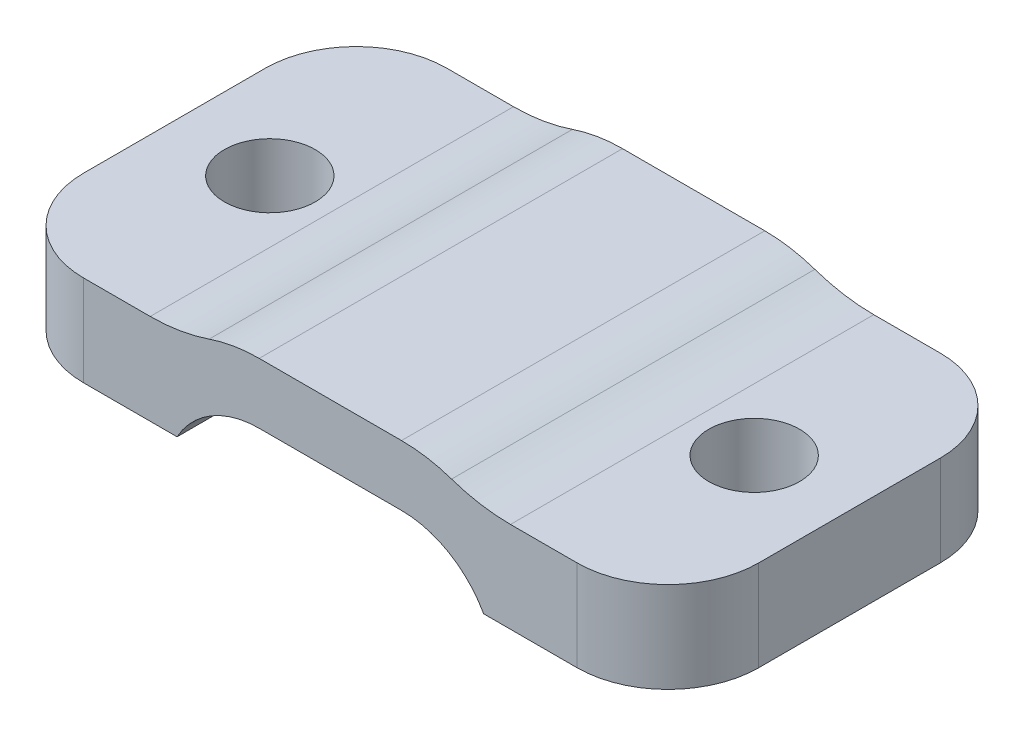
from build123d import *

# Parameters (mm, degrees)
BOSS_EXTRUDE1_DEPTH     = 12
FILLET1_R               = 6
CUT_EXTRUDE1_DEPTH      = 19.309833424
CUT_EXTRUDE1_DEPTH_BACK = 19.309833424
SKETCH2_R               = 1.5
FILLET2_R               = 3


with BuildPart() as part:
    # Sketch1 → Boss-Extrude1 (new body)
    with BuildSketch(Plane.XY):
        with BuildLine():
            Line((-8.8, 1.5), (-4.874423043, 1.5))
            ThreePointArc((-4.874423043, 1.5), (-3.934375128, 3.245102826), (-2.4, 4.5))
            Line((-2.4, 4.5), (-8.8, 4.5))
            Line((-8.8, 4.5), (-8.8, 1.5))
        make_face()
        with BuildLine():
            ThreePointArc((-2.712931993, 1.5), (-1.574801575, 2.670205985), (0, 3.1))
            Line((0, 3.1), (4.7, 3.1))
            ThreePointArc((4.7, 3.1), (6.274801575, 2.670205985), (7.412931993, 1.5))
            Line((7.412931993, 1.5), (9.574423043, 1.5))
            ThreePointArc((9.574423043, 1.5), (8.634375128, 3.245102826), (7.1, 4.5))
            Line((7.1, 4.5), (-2.4, 4.5))
            ThreePointArc((-2.4, 4.5), (-3.934375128, 3.245102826), (-4.874423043, 1.5))
            Line((-4.874423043, 1.5), (-2.712931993, 1.5))
        make_face()
        with BuildLine():
            ThreePointArc((7.1, 4.5), (8.634375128, 3.245102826), (9.574423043, 1.5))
            Line((9.574423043, 1.5), (13.5, 1.5))
            Line((13.5, 1.5), (13.5, 4.5))
            Line((13.5, 4.5), (7.1, 4.5))
        make_face()
        with BuildLine():
            ThreePointArc((0, 5.1), (-1.236931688, 4.947726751), (-2.4, 4.5))
            Line((-2.4, 4.5), (7.1, 4.5))
            ThreePointArc((7.1, 4.5), (5.936931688, 4.947726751), (4.7, 5.1))
            Line((4.7, 5.1), (0, 5.1))
        make_face()
    extrude(amount=BOSS_EXTRUDE1_DEPTH)

    # Fillet1
    fillet1_edges = [part.edges().sort_by_distance(p)[0] for p in [
        (-2.4, 4.5, 6),
        (7.1, 4.5, 6),
    ]]
    fillet(fillet1_edges, radius=FILLET1_R)

    # Sketch2 → Cut-Extrude1 (cut, two sides: drawn at the far end of the back side and taken through both)
    with BuildSketch(Plane(origin=(0, 4.5, 0), x_dir=(1, 0, 0), z_dir=(0, 1, 0)).offset(-CUT_EXTRUDE1_DEPTH_BACK)):
        with Locations(Location((-5.65, -6, 0), (0, 0, 270))):
            Circle(SKETCH2_R)
        with Locations(Location((10.35, -6, 0), (0, 0, 270))):
            Circle(SKETCH2_R)
    extrude(amount=CUT_EXTRUDE1_DEPTH + CUT_EXTRUDE1_DEPTH_BACK, mode=Mode.SUBTRACT)

    # Fillet2
    fillet2_edges = [part.edges().sort_by_distance(p)[0] for p in [
        (-8.8, 3, 0),
        (13.5, 3, 0),
        (13.5, 3, 12),
        (-8.8, 3, 12),
    ]]
    fillet(fillet2_edges, radius=FILLET2_R)


solid = part.part
